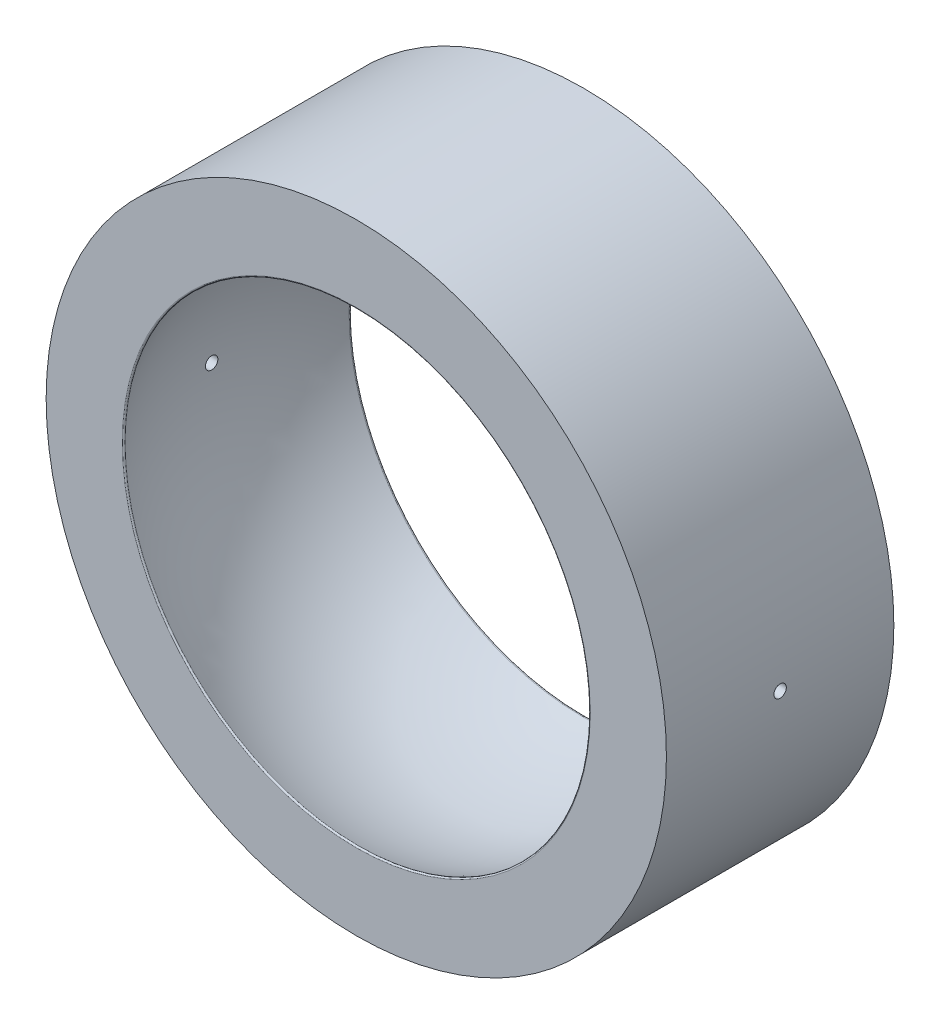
ISO-10303-21;
HEADER;
FILE_DESCRIPTION(('STEP AP214'),'2;1');
FILE_NAME('part.step','',(''),(''),'','','');
FILE_SCHEMA(('AUTOMOTIVE_DESIGN { 1 0 10303 214 1 1 1 1 }'));
ENDSEC;
DATA;
#1=APPLICATION_CONTEXT('core data for automotive mechanical design processes');
#2=APPLICATION_PROTOCOL_DEFINITION('international standard','automotive_design',2000,#1);
#3=PRODUCT_CONTEXT('',#1,'mechanical');
#4=PRODUCT('Part','Part','',(#3));
#5=PRODUCT_RELATED_PRODUCT_CATEGORY('part','',(#4));
#6=PRODUCT_DEFINITION_FORMATION('','',#4);
#7=PRODUCT_DEFINITION_CONTEXT('part definition',#1,'design');
#8=PRODUCT_DEFINITION('design','',#6,#7);
#9=PRODUCT_DEFINITION_SHAPE('','',#8);
#10=(LENGTH_UNIT() NAMED_UNIT(*) SI_UNIT(.MILLI.,.METRE.));
#11=(NAMED_UNIT(*) PLANE_ANGLE_UNIT() SI_UNIT($,.RADIAN.));
#12=(NAMED_UNIT(*) SI_UNIT($,.STERADIAN.) SOLID_ANGLE_UNIT());
#13=UNCERTAINTY_MEASURE_WITH_UNIT(LENGTH_MEASURE(1.E-05),#10,'distance_accuracy_value','');
#14=(GEOMETRIC_REPRESENTATION_CONTEXT(3) GLOBAL_UNCERTAINTY_ASSIGNED_CONTEXT((#13)) GLOBAL_UNIT_ASSIGNED_CONTEXT((#10,
#11,#12)) REPRESENTATION_CONTEXT('',''));
#15=CARTESIAN_POINT('',(0.,0.,0.));
#16=DIRECTION('',(0.,0.,1.));
#17=DIRECTION('',(1.,0.,0.));
#18=AXIS2_PLACEMENT_3D('',#15,#16,#17);
#19=CARTESIAN_POINT('',(68.9999999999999,0.,0.));
#20=DIRECTION('',(0.,0.,0.999999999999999));
#21=DIRECTION('',(-0.999999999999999,0.,0.));
#22=AXIS2_PLACEMENT_3D('',#19,#20,#21);
#23=DEGENERATE_TOROIDAL_SURFACE('',#22,0.0296511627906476,12.4703488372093,.T.);
#24=CARTESIAN_POINT('',(68.9999999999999,0.,-5.41395102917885));
#25=DIRECTION('',(0.,0.,-0.999999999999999));
#26=DIRECTION('',(0.,1.,0.));
#27=AXIS2_PLACEMENT_3D('',#24,#25,#26);
#28=CIRCLE('',#27,11.2634721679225);
#29=CARTESIAN_POINT('',(68.9999999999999,11.2634721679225,-5.41395102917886));
#30=VERTEX_POINT('',#29);
#31=EDGE_CURVE('E57',#30,#30,#28,.T.);
#32=ORIENTED_EDGE('',*,*,#31,.T.);
#33=EDGE_LOOP('',(#32));
#34=FACE_BOUND('',#33,.T.);
#35=CARTESIAN_POINT('',(81.4963909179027,-1.11022302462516E-13,0.300000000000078));
#36=CARTESIAN_POINT('',(81.4963909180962,0.0168414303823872,0.299998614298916));
#37=CARTESIAN_POINT('',(81.4963909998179,0.0336981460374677,0.298576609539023));
#38=CARTESIAN_POINT('',(81.4963913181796,0.0669618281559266,0.292919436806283));
#39=CARTESIAN_POINT('',(81.496391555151,0.0833677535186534,0.288678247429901));
#40=CARTESIAN_POINT('',(81.4963921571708,0.115222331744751,0.277503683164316));
#41=CARTESIAN_POINT('',(81.4963925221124,0.130671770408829,0.270572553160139));
#42=CARTESIAN_POINT('',(81.496393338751,0.160179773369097,0.254218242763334));
#43=CARTESIAN_POINT('',(81.496393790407,0.174238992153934,0.244796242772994));
#44=CARTESIAN_POINT('',(81.4963947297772,0.200579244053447,0.223724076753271));
#45=CARTESIAN_POINT('',(81.4963952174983,0.212859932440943,0.212073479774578));
#46=CARTESIAN_POINT('',(81.4963961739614,0.235292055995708,0.186874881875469));
#47=CARTESIAN_POINT('',(81.4963966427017,0.245443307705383,0.17332671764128));
#48=CARTESIAN_POINT('',(81.4963975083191,0.263326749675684,0.14471892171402));
#49=CARTESIAN_POINT('',(81.4963979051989,0.271059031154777,0.129659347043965));
#50=CARTESIAN_POINT('',(81.4963985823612,0.283885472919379,0.0984559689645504));
#51=CARTESIAN_POINT('',(81.496398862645,0.288979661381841,0.0823121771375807));
#52=CARTESIAN_POINT('',(81.49639927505,0.296385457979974,0.0493984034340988));
#53=CARTESIAN_POINT('',(81.4963994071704,0.298697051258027,0.0326284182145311));
#54=CARTESIAN_POINT('',(81.4963995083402,0.300471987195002,-0.00106161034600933));
#55=CARTESIAN_POINT('',(81.4963994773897,0.299935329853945,-0.0179816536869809));
#56=CARTESIAN_POINT('',(81.4963992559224,0.296029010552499,-0.0514913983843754));
#57=CARTESIAN_POINT('',(81.4963990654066,0.292659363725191,-0.0680811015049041));
#58=CARTESIAN_POINT('',(81.4963985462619,0.2831826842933,-0.100459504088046));
#59=CARTESIAN_POINT('',(81.4963982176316,0.277075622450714,-0.116248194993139));
#60=CARTESIAN_POINT('',(81.4963974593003,0.26229720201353,-0.146576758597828));
#61=CARTESIAN_POINT('',(81.4963970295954,0.253625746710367,-0.161116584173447));
#62=CARTESIAN_POINT('',(81.4963961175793,0.233965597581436,-0.188532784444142));
#63=CARTESIAN_POINT('',(81.4963956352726,0.22297710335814,-0.20140930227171));
#64=CARTESIAN_POINT('',(81.4963946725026,0.198996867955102,-0.225132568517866));
#65=CARTESIAN_POINT('',(81.4963941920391,0.186005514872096,-0.235979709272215));
#66=CARTESIAN_POINT('',(81.4963932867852,0.15837932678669,-0.255344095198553));
#67=CARTESIAN_POINT('',(81.4963928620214,0.143743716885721,-0.26386023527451));
#68=CARTESIAN_POINT('',(81.4963921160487,0.113239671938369,-0.278320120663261));
#69=CARTESIAN_POINT('',(81.4963917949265,0.0973702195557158,-0.284261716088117));
#70=CARTESIAN_POINT('',(81.4963912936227,0.0648851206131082,-0.293382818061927));
#71=CARTESIAN_POINT('',(81.4963911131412,0.0482711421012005,-0.296568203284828));
#72=CARTESIAN_POINT('',(81.4963909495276,0.0210523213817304,-0.299446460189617));
#73=CARTESIAN_POINT('',(81.4963909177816,0.0105291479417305,-0.300000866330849));
#74=CARTESIAN_POINT('',(81.4963909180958,-0.0168414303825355,-0.299998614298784));
#75=CARTESIAN_POINT('',(81.4963909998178,-0.0336981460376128,-0.298576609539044));
#76=CARTESIAN_POINT('',(81.4963913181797,-0.0669618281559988,-0.292919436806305));
#77=CARTESIAN_POINT('',(81.4963915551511,-0.0833677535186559,-0.28867824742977));
#78=CARTESIAN_POINT('',(81.4963921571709,-0.115222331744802,-0.277503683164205));
#79=CARTESIAN_POINT('',(81.4963925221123,-0.130671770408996,-0.270572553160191));
#80=CARTESIAN_POINT('',(81.496393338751,-0.160179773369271,-0.254218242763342));
#81=CARTESIAN_POINT('',(81.4963937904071,-0.174238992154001,-0.244796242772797));
#82=CARTESIAN_POINT('',(81.4963947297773,-0.200579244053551,-0.223724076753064));
#83=CARTESIAN_POINT('',(81.4963952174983,-0.2128599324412,-0.212073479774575));
#84=CARTESIAN_POINT('',(81.4963961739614,-0.23529205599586,-0.186874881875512));
#85=CARTESIAN_POINT('',(81.4963966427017,-0.245443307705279,-0.173326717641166));
#86=CARTESIAN_POINT('',(81.4963975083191,-0.26332674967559,-0.144718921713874));
#87=CARTESIAN_POINT('',(81.4963979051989,-0.271059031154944,-0.129659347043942));
#88=CARTESIAN_POINT('',(81.4963985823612,-0.28388547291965,-0.0984559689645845));
#89=CARTESIAN_POINT('',(81.4963988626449,-0.288979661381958,-0.0823121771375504));
#90=CARTESIAN_POINT('',(81.4963992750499,-0.296385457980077,-0.0493984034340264));
#91=CARTESIAN_POINT('',(81.4963994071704,-0.298697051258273,-0.0326284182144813));
#92=CARTESIAN_POINT('',(81.4963995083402,-0.300471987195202,0.00106161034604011));
#93=CARTESIAN_POINT('',(81.4963994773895,-0.299935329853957,0.0179816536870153));
#94=CARTESIAN_POINT('',(81.4963992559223,-0.296029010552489,0.0514913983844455));
#95=CARTESIAN_POINT('',(81.4963990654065,-0.292659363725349,0.0680811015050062));
#96=CARTESIAN_POINT('',(81.496398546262,-0.283182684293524,0.100459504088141));
#97=CARTESIAN_POINT('',(81.4963982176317,-0.277075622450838,0.116248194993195));
#98=CARTESIAN_POINT('',(81.4963974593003,-0.262297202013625,0.146576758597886));
#99=CARTESIAN_POINT('',(81.4963970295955,-0.253625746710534,0.161116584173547));
#100=CARTESIAN_POINT('',(81.4963961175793,-0.233965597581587,0.188532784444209));
#101=CARTESIAN_POINT('',(81.4963956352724,-0.222977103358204,0.201409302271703));
#102=CARTESIAN_POINT('',(81.4963946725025,-0.198996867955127,0.225132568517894));
#103=CARTESIAN_POINT('',(81.496394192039,-0.186005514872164,0.235979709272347));
#104=CARTESIAN_POINT('',(81.4963932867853,-0.158379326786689,0.255344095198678));
#105=CARTESIAN_POINT('',(81.4963928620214,-0.143743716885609,0.263860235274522));
#106=CARTESIAN_POINT('',(81.4963921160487,-0.113239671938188,0.27832012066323));
#107=CARTESIAN_POINT('',(81.4963917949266,-0.0973702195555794,0.284261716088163));
#108=CARTESIAN_POINT('',(81.4963912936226,-0.0648851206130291,0.29338281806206));
#109=CARTESIAN_POINT('',(81.496391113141,-0.0482711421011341,0.296568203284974));
#110=CARTESIAN_POINT('',(81.4963909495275,-0.021052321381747,0.299446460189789));
#111=CARTESIAN_POINT('',(81.4963909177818,-0.010529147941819,0.300000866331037));
#112=CARTESIAN_POINT('',(81.4963909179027,-1.11022302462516E-13,0.300000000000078));
#113=B_SPLINE_CURVE_WITH_KNOTS('',3,(#35,#36,#37,#38,#39,#40,#41,#42,#43,#44,#45,#46,#47,#48,
#49,#50,#51,#52,#53,#54,#55,#56,#57,#58,#59,#60,#61,#62,#63,#64,#65,#66,#67,#68,#69,#70,#71,#72,
#73,#74,#75,#76,#77,#78,#79,#80,#81,#82,#83,#84,#85,#86,#87,#88,#89,#90,#91,#92,#93,#94,#95,#96,
#97,#98,#99,#100,#101,#102,#103,#104,#105,#106,#107,#108,#109,#110,#111,#112),.UNSPECIFIED.,.T.,
.F.,(4,2,2,2,2,2,2,2,2,2,2,2,2,2,2,2,2,2,2,2,2,2,2,2,2,2,2,2,2,2,2,2,2,2,2,2,2,2,4),(0.,
0.0504912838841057,0.101090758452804,0.151648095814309,0.202181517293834,0.252724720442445,
0.303272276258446,0.353817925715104,0.404363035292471,0.454908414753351,0.505453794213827,
0.555998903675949,0.606544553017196,0.657092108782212,0.707635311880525,0.758168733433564,
0.808726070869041,0.859325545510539,0.909816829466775,0.941383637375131,0.991874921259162,
1.04247439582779,1.09303173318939,1.14356515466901,1.19410835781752,1.24465591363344,
1.29520156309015,1.34574667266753,1.39629205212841,1.44683743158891,1.49738254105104,
1.54792819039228,1.59847574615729,1.64901894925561,1.69955237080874,1.75010970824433,
1.80070918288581,1.851200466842,1.88276727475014),.UNSPECIFIED.);
#114=CARTESIAN_POINT('',(81.4963909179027,-1.11022302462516E-13,0.300000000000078));
#115=VERTEX_POINT('',#114);
#116=EDGE_CURVE('E84',#115,#115,#113,.T.);
#117=ORIENTED_EDGE('',*,*,#116,.F.);
#118=EDGE_LOOP('',(#117));
#119=FACE_BOUND('',#118,.T.);
#120=CARTESIAN_POINT('',(69.0000000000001,0.,5.41395124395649));
#121=DIRECTION('',(0.,0.,0.999999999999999));
#122=DIRECTION('',(0.,-1.,0.));
#123=AXIS2_PLACEMENT_3D('',#120,#121,#122);
#124=CIRCLE('',#123,11.263472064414);
#125=CARTESIAN_POINT('',(69.0000000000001,-11.263472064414,5.4139512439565));
#126=VERTEX_POINT('',#125);
#127=EDGE_CURVE('E107',#126,#126,#124,.T.);
#128=ORIENTED_EDGE('',*,*,#127,.T.);
#129=EDGE_LOOP('',(#128));
#130=FACE_BOUND('',#129,.T.);
#131=CARTESIAN_POINT('',(56.5036090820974,0.,-0.299999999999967));
#132=CARTESIAN_POINT('',(56.503609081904,0.0168414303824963,-0.299998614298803));
#133=CARTESIAN_POINT('',(56.5036090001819,0.0336981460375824,-0.298576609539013));
#134=CARTESIAN_POINT('',(56.5036086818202,0.066961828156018,-0.292919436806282));
#135=CARTESIAN_POINT('',(56.503608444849,0.083367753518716,-0.288678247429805));
#136=CARTESIAN_POINT('',(56.5036078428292,0.11522233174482,-0.277503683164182));
#137=CARTESIAN_POINT('',(56.5036074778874,0.130671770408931,-0.27057255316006));
#138=CARTESIAN_POINT('',(56.5036066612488,0.160179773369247,-0.254218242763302));
#139=CARTESIAN_POINT('',(56.503606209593,0.174238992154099,-0.244796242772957));
#140=CARTESIAN_POINT('',(56.5036052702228,0.200579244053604,-0.223724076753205));
#141=CARTESIAN_POINT('',(56.5036047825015,0.212859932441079,-0.212073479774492));
#142=CARTESIAN_POINT('',(56.5036038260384,0.235292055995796,-0.186874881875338));
#143=CARTESIAN_POINT('',(56.5036033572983,0.245443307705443,-0.173326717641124));
#144=CARTESIAN_POINT('',(56.5036024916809,0.263326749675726,-0.144718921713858));
#145=CARTESIAN_POINT('',(56.5036020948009,0.27105903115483,-0.129659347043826));
#146=CARTESIAN_POINT('',(56.5036014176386,0.283885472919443,-0.0984559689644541));
#147=CARTESIAN_POINT('',(56.5036011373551,0.288979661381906,-0.0823121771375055));
#148=CARTESIAN_POINT('',(56.5036007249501,0.296385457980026,-0.049398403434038));
#149=CARTESIAN_POINT('',(56.5036005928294,0.298697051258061,-0.0326284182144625));
#150=CARTESIAN_POINT('',(56.5036004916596,0.300471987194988,0.00106161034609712));
#151=CARTESIAN_POINT('',(56.5036005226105,0.299935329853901,0.0179816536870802));
#152=CARTESIAN_POINT('',(56.5036007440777,0.296029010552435,0.0514913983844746));
#153=CARTESIAN_POINT('',(56.5036009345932,0.292659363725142,0.0680811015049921));
#154=CARTESIAN_POINT('',(56.5036014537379,0.283182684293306,0.100459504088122));
#155=CARTESIAN_POINT('',(56.5036017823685,0.277075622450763,0.116248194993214));
#156=CARTESIAN_POINT('',(56.5036025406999,0.262297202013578,0.146576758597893));
#157=CARTESIAN_POINT('',(56.5036029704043,0.253625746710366,0.161116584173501));
#158=CARTESIAN_POINT('',(56.5036038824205,0.233965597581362,0.188532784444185));
#159=CARTESIAN_POINT('',(56.5036043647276,0.222977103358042,0.201409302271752));
#160=CARTESIAN_POINT('',(56.5036053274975,0.198996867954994,0.225132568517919));
#161=CARTESIAN_POINT('',(56.5036058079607,0.186005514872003,0.235979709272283));
#162=CARTESIAN_POINT('',(56.5036067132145,0.158379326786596,0.255344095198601));
#163=CARTESIAN_POINT('',(56.5036071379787,0.143743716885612,0.263860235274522));
#164=CARTESIAN_POINT('',(56.5036078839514,0.113239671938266,0.278320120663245));
#165=CARTESIAN_POINT('',(56.5036082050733,0.0973702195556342,0.284261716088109));
#166=CARTESIAN_POINT('',(56.5036087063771,0.0648851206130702,0.293382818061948));
#167=CARTESIAN_POINT('',(56.5036088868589,0.0482711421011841,0.29656820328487));
#168=CARTESIAN_POINT('',(56.5036090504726,0.0210523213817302,0.299446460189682));
#169=CARTESIAN_POINT('',(56.5036090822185,0.0105291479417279,0.30000086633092));
#170=CARTESIAN_POINT('',(56.5036090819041,-0.016841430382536,0.299998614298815));
#171=CARTESIAN_POINT('',(56.5036090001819,-0.0336981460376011,0.298576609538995));
#172=CARTESIAN_POINT('',(56.5036086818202,-0.0669618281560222,0.292919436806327));
#173=CARTESIAN_POINT('',(56.503608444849,-0.0833677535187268,0.288678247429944));
#174=CARTESIAN_POINT('',(56.5036078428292,-0.115222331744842,0.277503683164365));
#175=CARTESIAN_POINT('',(56.5036074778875,-0.130671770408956,0.270572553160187));
#176=CARTESIAN_POINT('',(56.5036066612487,-0.160179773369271,0.254218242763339));
#177=CARTESIAN_POINT('',(56.5036062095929,-0.17423899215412,0.244796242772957));
#178=CARTESIAN_POINT('',(56.5036052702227,-0.200579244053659,0.223724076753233));
#179=CARTESIAN_POINT('',(56.5036047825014,-0.212859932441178,0.212073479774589));
#180=CARTESIAN_POINT('',(56.5036038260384,-0.23529205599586,0.186874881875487));
#181=CARTESIAN_POINT('',(56.5036033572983,-0.24544330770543,0.173326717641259));
#182=CARTESIAN_POINT('',(56.5036024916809,-0.263326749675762,0.14471892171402));
#183=CARTESIAN_POINT('',(56.5036020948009,-0.271059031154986,0.129659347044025));
#184=CARTESIAN_POINT('',(56.5036014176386,-0.283885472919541,0.0984559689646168));
#185=CARTESIAN_POINT('',(56.5036011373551,-0.288979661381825,0.082312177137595));
#186=CARTESIAN_POINT('',(56.5036007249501,-0.296385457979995,0.0493984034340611));
#187=CARTESIAN_POINT('',(56.5036005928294,-0.298697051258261,0.0326284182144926));
#188=CARTESIAN_POINT('',(56.5036004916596,-0.300471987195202,-0.00106161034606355));
#189=CARTESIAN_POINT('',(56.5036005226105,-0.299935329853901,-0.01798165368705));
#190=CARTESIAN_POINT('',(56.5036007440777,-0.296029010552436,-0.0514913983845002));
#191=CARTESIAN_POINT('',(56.5036009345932,-0.292659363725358,-0.0680811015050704));
#192=CARTESIAN_POINT('',(56.5036014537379,-0.283182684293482,-0.100459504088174));
#193=CARTESIAN_POINT('',(56.5036017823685,-0.277075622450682,-0.116248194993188));
#194=CARTESIAN_POINT('',(56.5036025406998,-0.262297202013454,-0.146576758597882));
#195=CARTESIAN_POINT('',(56.5036029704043,-0.253625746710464,-0.161116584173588));
#196=CARTESIAN_POINT('',(56.5036038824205,-0.233965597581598,-0.188532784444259));
#197=CARTESIAN_POINT('',(56.5036043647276,-0.222977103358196,-0.201409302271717));
#198=CARTESIAN_POINT('',(56.5036053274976,-0.198996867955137,-0.225132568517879));
#199=CARTESIAN_POINT('',(56.5036058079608,-0.18600551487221,-0.23597970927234));
#200=CARTESIAN_POINT('',(56.5036067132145,-0.158379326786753,-0.255344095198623));
#201=CARTESIAN_POINT('',(56.5036071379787,-0.143743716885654,-0.263860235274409));
#202=CARTESIAN_POINT('',(56.5036078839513,-0.113239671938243,-0.278320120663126));
#203=CARTESIAN_POINT('',(56.5036082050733,-0.0973702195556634,-0.284261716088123));
#204=CARTESIAN_POINT('',(56.5036087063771,-0.0648851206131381,-0.293382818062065));
#205=CARTESIAN_POINT('',(56.5036088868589,-0.04827114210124,-0.296568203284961));
#206=CARTESIAN_POINT('',(56.5036090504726,-0.0210523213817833,-0.299446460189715));
#207=CARTESIAN_POINT('',(56.5036090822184,-0.0105291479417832,-0.300000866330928));
#208=CARTESIAN_POINT('',(56.5036090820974,0.,-0.299999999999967));
#209=B_SPLINE_CURVE_WITH_KNOTS('',3,(#131,#132,#133,#134,#135,#136,#137,#138,#139,#140,#141,
#142,#143,#144,#145,#146,#147,#148,#149,#150,#151,#152,#153,#154,#155,#156,#157,#158,#159,#160,
#161,#162,#163,#164,#165,#166,#167,#168,#169,#170,#171,#172,#173,#174,#175,#176,#177,#178,#179,
#180,#181,#182,#183,#184,#185,#186,#187,#188,#189,#190,#191,#192,#193,#194,#195,#196,#197,#198,
#199,#200,#201,#202,#203,#204,#205,#206,#207,#208),.UNSPECIFIED.,.T.,.F.,(4,2,2,2,2,2,2,2,2,2,2,
2,2,2,2,2,2,2,2,2,2,2,2,2,2,2,2,2,2,2,2,2,2,2,2,2,2,2,4),(0.,0.0504912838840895,
0.101090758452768,0.151648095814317,0.202181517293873,0.252724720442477,0.303272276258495,
0.353817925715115,0.404363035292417,0.454908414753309,0.505453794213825,0.555998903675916,
0.606544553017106,0.657092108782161,0.70763531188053,0.758168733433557,0.808726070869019,
0.859325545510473,0.909816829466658,0.941383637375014,0.99187492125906,1.04247439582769,
1.09303173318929,1.14356515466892,1.19410835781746,1.24465591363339,1.29520156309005,
1.34574667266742,1.39629205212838,1.44683743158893,1.49738254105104,1.54792819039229,
1.59847574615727,1.64901894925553,1.6995523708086,1.75010970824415,1.80070918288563,
1.8512004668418,1.88276727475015),.UNSPECIFIED.);
#210=CARTESIAN_POINT('',(56.5036090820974,0.,-0.299999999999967));
#211=VERTEX_POINT('',#210);
#212=EDGE_CURVE('E40',#211,#211,#209,.T.);
#213=ORIENTED_EDGE('',*,*,#212,.F.);
#214=EDGE_LOOP('',(#213));
#215=FACE_BOUND('',#214,.T.);
#216=ADVANCED_FACE('F36',(#34,#119,#130,#215),#23,.F.);
#217=CARTESIAN_POINT('',(68.9999999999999,0.,-5.43999999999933));
#218=DIRECTION('',(0.,0.,0.999999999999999));
#219=DIRECTION('',(-0.999999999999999,0.,0.));
#220=AXIS2_PLACEMENT_3D('',#217,#218,#219);
#221=TOROIDAL_SURFACE('',#220,11.3175226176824,0.06000000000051);
#222=CARTESIAN_POINT('',(69.0000000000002,0.,-5.49999999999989));
#223=DIRECTION('',(0.,0.,-0.999999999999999));
#224=DIRECTION('',(-0.999999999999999,0.,0.));
#225=AXIS2_PLACEMENT_3D('',#222,#223,#224);
#226=CIRCLE('',#225,11.3175226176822);
#227=CARTESIAN_POINT('',(57.682477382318,0.,-5.4999999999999));
#228=VERTEX_POINT('',#227);
#229=EDGE_CURVE('E90',#228,#228,#226,.T.);
#230=ORIENTED_EDGE('',*,*,#229,.T.);
#231=EDGE_LOOP('',(#230));
#232=FACE_BOUND('',#231,.T.);
#233=ORIENTED_EDGE('',*,*,#31,.F.);
#234=EDGE_LOOP('',(#233));
#235=FACE_BOUND('',#234,.T.);
#236=ADVANCED_FACE('F93',(#232,#235),#221,.T.);
#237=CARTESIAN_POINT('',(69.0000000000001,0.,5.44));
#238=DIRECTION('',(0.,0.,0.999999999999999));
#239=DIRECTION('',(0.,1.,0.));
#240=AXIS2_PLACEMENT_3D('',#237,#238,#239);
#241=TOROIDAL_SURFACE('',#240,11.3175226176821,0.0599999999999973);
#242=CARTESIAN_POINT('',(69.,-1.11022302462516E-13,5.50000000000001));
#243=DIRECTION('',(0.,0.,-0.999999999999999));
#244=DIRECTION('',(0.,1.,0.));
#245=AXIS2_PLACEMENT_3D('',#242,#243,#244);
#246=CIRCLE('',#245,11.3175226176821);
#247=CARTESIAN_POINT('',(69.,11.317522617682,5.5));
#248=VERTEX_POINT('',#247);
#249=EDGE_CURVE('E111',#248,#248,#246,.F.);
#250=ORIENTED_EDGE('',*,*,#249,.T.);
#251=EDGE_LOOP('',(#250));
#252=FACE_BOUND('',#251,.T.);
#253=ORIENTED_EDGE('',*,*,#127,.F.);
#254=EDGE_LOOP('',(#253));
#255=FACE_BOUND('',#254,.T.);
#256=ADVANCED_FACE('F38',(#252,#255),#241,.T.);
#257=CARTESIAN_POINT('',(85.,-1.11022302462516E-13,0.));
#258=DIRECTION('',(-0.999999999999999,0.,0.));
#259=DIRECTION('',(0.,0.,-0.999999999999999));
#260=AXIS2_PLACEMENT_3D('',#257,#258,#259);
#261=CYLINDRICAL_SURFACE('',#260,0.3);
#262=CARTESIAN_POINT('',(54.0000000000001,0.,-0.299999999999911));
#263=CARTESIAN_POINT('',(54.0000000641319,-0.0168396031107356,-0.299998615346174));
#264=CARTESIAN_POINT('',(54.0000286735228,-0.0336944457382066,-0.298576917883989));
#265=CARTESIAN_POINT('',(54.0001401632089,-0.0669543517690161,-0.292921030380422));
#266=CARTESIAN_POINT('',(54.0002231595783,-0.0833583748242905,-0.288680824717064));
#267=CARTESIAN_POINT('',(54.000433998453,-0.115209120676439,-0.277509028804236));
#268=CARTESIAN_POINT('',(54.0005618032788,-0.130656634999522,-0.270579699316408));
#269=CARTESIAN_POINT('',(54.0008478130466,-0.160161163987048,-0.25422979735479));
#270=CARTESIAN_POINT('',(54.0010060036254,-0.174218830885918,-0.244810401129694));
#271=CARTESIAN_POINT('',(54.0013350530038,-0.200558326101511,-0.223742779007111));
#272=CARTESIAN_POINT('',(54.0015059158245,-0.21283958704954,-0.212093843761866));
#273=CARTESIAN_POINT('',(54.0018410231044,-0.235273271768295,-0.186898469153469));
#274=CARTESIAN_POINT('',(54.0020052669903,-0.245425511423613,-0.173351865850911));
#275=CARTESIAN_POINT('',(54.002308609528,-0.263312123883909,-0.144745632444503));
#276=CARTESIAN_POINT('',(54.0024477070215,-0.271046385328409,-0.129685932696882));
#277=CARTESIAN_POINT('',(54.0026850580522,-0.283876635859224,-0.0984816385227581));
#278=CARTESIAN_POINT('',(54.0027833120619,-0.28897265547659,-0.0823370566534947));
#279=CARTESIAN_POINT('',(54.0029278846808,-0.29638124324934,-0.0494233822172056));
#280=CARTESIAN_POINT('',(54.0029742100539,-0.298694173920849,-0.0326543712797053));
#281=CARTESIAN_POINT('',(54.0030097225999,-0.300472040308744,0.00103400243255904));
#282=CARTESIAN_POINT('',(54.0029989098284,-0.299936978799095,0.0179533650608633));
#283=CARTESIAN_POINT('',(54.0029213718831,-0.296034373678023,0.0514595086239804));
#284=CARTESIAN_POINT('',(54.0028546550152,-0.29266725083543,0.0680463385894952));
#285=CARTESIAN_POINT('',(54.0026728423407,-0.283196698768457,0.100419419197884));
#286=CARTESIAN_POINT('',(54.0025577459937,-0.277093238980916,0.1162056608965));
#287=CARTESIAN_POINT('',(54.0022921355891,-0.26232253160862,0.146531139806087));
#288=CARTESIAN_POINT('',(54.0021416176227,-0.253655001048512,0.161070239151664));
#289=CARTESIAN_POINT('',(54.0018221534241,-0.234003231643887,0.188485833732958));
#290=CARTESIAN_POINT('',(54.0016532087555,-0.223019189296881,0.201362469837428));
#291=CARTESIAN_POINT('',(54.0013159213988,-0.199045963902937,0.225089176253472));
#292=CARTESIAN_POINT('',(54.0011475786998,-0.186056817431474,0.235939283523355));
#293=CARTESIAN_POINT('',(54.0008303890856,-0.158434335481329,0.255309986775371));
#294=CARTESIAN_POINT('',(54.0006815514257,-0.143800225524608,0.263829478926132));
#295=CARTESIAN_POINT('',(54.0004201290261,-0.113298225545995,0.278296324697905));
#296=CARTESIAN_POINT('',(54.0003075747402,-0.0974293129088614,0.284241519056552));
#297=CARTESIAN_POINT('',(54.0001318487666,-0.0649444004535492,0.29336975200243));
#298=CARTESIAN_POINT('',(54.0000685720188,-0.0483300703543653,0.296558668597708));
#299=CARTESIAN_POINT('',(54.000011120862,-0.0210913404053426,0.299444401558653));
#300=CARTESIAN_POINT('',(53.9999999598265,-0.0105486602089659,0.300000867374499));
#301=CARTESIAN_POINT('',(54.0000000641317,0.0168396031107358,0.29999861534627));
#302=CARTESIAN_POINT('',(54.0000286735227,0.0336944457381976,0.298576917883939));
#303=CARTESIAN_POINT('',(54.0001401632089,0.066954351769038,0.292921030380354));
#304=CARTESIAN_POINT('',(54.0002231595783,0.0833583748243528,0.288680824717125));
#305=CARTESIAN_POINT('',(54.000433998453,0.115209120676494,0.277509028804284));
#306=CARTESIAN_POINT('',(54.0005618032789,0.130656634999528,0.270579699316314));
#307=CARTESIAN_POINT('',(54.0008478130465,0.16016116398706,0.2542297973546));
#308=CARTESIAN_POINT('',(54.0010060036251,0.174218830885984,0.244810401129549));
#309=CARTESIAN_POINT('',(54.0013350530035,0.20055832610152,0.223742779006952));
#310=CARTESIAN_POINT('',(54.0015059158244,0.212839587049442,0.21209384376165));
#311=CARTESIAN_POINT('',(54.0018410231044,0.23527327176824,0.186898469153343));
#312=CARTESIAN_POINT('',(54.0020052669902,0.245425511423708,0.173351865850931));
#313=CARTESIAN_POINT('',(54.0023086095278,0.263312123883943,0.144745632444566));
#314=CARTESIAN_POINT('',(54.0024477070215,0.271046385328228,0.12968593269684));
#315=CARTESIAN_POINT('',(54.0026850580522,0.283876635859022,0.0984816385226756));
#316=CARTESIAN_POINT('',(54.0027833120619,0.288972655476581,0.0823370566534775));
#317=CARTESIAN_POINT('',(54.0029278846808,0.296381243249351,0.0494233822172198));
#318=CARTESIAN_POINT('',(54.0029742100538,0.298694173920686,0.0326543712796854));
#319=CARTESIAN_POINT('',(54.0030097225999,0.300472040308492,-0.00103400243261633));
#320=CARTESIAN_POINT('',(54.0029989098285,0.299936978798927,-0.0179533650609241));
#321=CARTESIAN_POINT('',(54.0029213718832,0.29603437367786,-0.0514595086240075));
#322=CARTESIAN_POINT('',(54.0028546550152,0.292667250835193,-0.0680463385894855));
#323=CARTESIAN_POINT('',(54.0026728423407,0.283196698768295,-0.100419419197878));
#324=CARTESIAN_POINT('',(54.0025577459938,0.277093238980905,-0.116205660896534));
#325=CARTESIAN_POINT('',(54.0022921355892,0.262322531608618,-0.14653113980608));
#326=CARTESIAN_POINT('',(54.0021416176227,0.253655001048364,-0.161070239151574));
#327=CARTESIAN_POINT('',(54.0018221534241,0.234003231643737,-0.188485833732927));
#328=CARTESIAN_POINT('',(54.0016532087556,0.223019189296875,-0.201362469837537));
#329=CARTESIAN_POINT('',(54.0013159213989,0.199045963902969,-0.22508917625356));
#330=CARTESIAN_POINT('',(54.0011475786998,0.186056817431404,-0.235939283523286));
#331=CARTESIAN_POINT('',(54.0008303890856,0.158434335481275,-0.255309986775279));
#332=CARTESIAN_POINT('',(54.0006815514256,0.143800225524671,-0.263829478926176));
#333=CARTESIAN_POINT('',(54.0004201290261,0.113298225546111,-0.278296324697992));
#334=CARTESIAN_POINT('',(54.0003075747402,0.0974293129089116,-0.284241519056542));
#335=CARTESIAN_POINT('',(54.0001318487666,0.0649444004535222,-0.293369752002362));
#336=CARTESIAN_POINT('',(54.0000685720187,0.0483300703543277,-0.29655866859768));
#337=CARTESIAN_POINT('',(54.0000111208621,0.0210913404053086,-0.299444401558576));
#338=CARTESIAN_POINT('',(53.9999999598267,0.0105486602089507,-0.300000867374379));
#339=CARTESIAN_POINT('',(54.0000000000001,0.,-0.299999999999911));
#340=B_SPLINE_CURVE_WITH_KNOTS('',3,(#262,#263,#264,#265,#266,#267,#268,#269,#270,#271,#272,
#273,#274,#275,#276,#277,#278,#279,#280,#281,#282,#283,#284,#285,#286,#287,#288,#289,#290,#291,
#292,#293,#294,#295,#296,#297,#298,#299,#300,#301,#302,#303,#304,#305,#306,#307,#308,#309,#310,
#311,#312,#313,#314,#315,#316,#317,#318,#319,#320,#321,#322,#323,#324,#325,#326,#327,#328,#329,
#330,#331,#332,#333,#334,#335,#336,#337,#338,#339),.UNSPECIFIED.,.T.,.F.,(4,2,2,2,2,2,2,2,2,2,2,
2,2,2,2,2,2,2,2,2,2,2,2,2,2,2,2,2,2,2,2,2,2,2,2,2,2,2,4),(0.,0.0504857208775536,
0.101079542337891,0.151630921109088,0.202158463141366,0.252702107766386,0.303250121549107,
0.353800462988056,0.404350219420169,0.454893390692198,0.505436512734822,0.555972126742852,
0.606508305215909,0.65705006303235,0.707587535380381,0.758124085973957,0.808684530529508,
0.859287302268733,0.909781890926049,0.941407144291,0.991892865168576,1.04248668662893,
1.09303806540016,1.14356560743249,1.19410925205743,1.24465726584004,1.29520760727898,
1.3457573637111,1.39630053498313,1.44684365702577,1.49737927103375,1.54791544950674,
1.5984572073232,1.64899467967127,1.69953123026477,1.75009167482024,1.80069444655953,
1.85118903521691,1.8828142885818),.UNSPECIFIED.);
#341=CARTESIAN_POINT('',(54.0000000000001,0.,-0.299999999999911));
#342=VERTEX_POINT('',#341);
#343=EDGE_CURVE('E67',#342,#342,#340,.T.);
#344=ORIENTED_EDGE('',*,*,#343,.T.);
#345=EDGE_LOOP('',(#344));
#346=FACE_BOUND('',#345,.T.);
#347=ORIENTED_EDGE('',*,*,#212,.T.);
#348=EDGE_LOOP('',(#347));
#349=FACE_BOUND('',#348,.T.);
#350=ADVANCED_FACE('F80',(#346,#349),#261,.F.);
#351=CARTESIAN_POINT('',(85.,-1.11022302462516E-13,0.));
#352=DIRECTION('',(-0.999999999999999,0.,0.));
#353=DIRECTION('',(0.,0.,-0.999999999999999));
#354=AXIS2_PLACEMENT_3D('',#351,#352,#353);
#355=CYLINDRICAL_SURFACE('',#354,0.3);
#356=ORIENTED_EDGE('',*,*,#116,.T.);
#357=EDGE_LOOP('',(#356));
#358=FACE_BOUND('',#357,.T.);
#359=CARTESIAN_POINT('',(84.,-2.22044604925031E-13,0.299999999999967));
#360=CARTESIAN_POINT('',(83.9999999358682,-0.016839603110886,0.299998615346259));
#361=CARTESIAN_POINT('',(83.999971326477,-0.0336944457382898,0.298576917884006));
#362=CARTESIAN_POINT('',(83.9998598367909,-0.0669543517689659,0.292921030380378));
#363=CARTESIAN_POINT('',(83.9997768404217,-0.0833583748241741,0.288680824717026));
#364=CARTESIAN_POINT('',(83.999566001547,-0.115209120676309,0.277509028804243));
#365=CARTESIAN_POINT('',(83.999438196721,-0.130656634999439,0.270579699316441));
#366=CARTESIAN_POINT('',(83.9991521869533,-0.160161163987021,0.254229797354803));
#367=CARTESIAN_POINT('',(83.9989939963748,-0.174218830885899,0.244810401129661));
#368=CARTESIAN_POINT('',(83.9986649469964,-0.200558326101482,0.223742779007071));
#369=CARTESIAN_POINT('',(83.9984940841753,-0.212839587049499,0.212093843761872));
#370=CARTESIAN_POINT('',(83.9981589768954,-0.235273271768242,0.18689846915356));
#371=CARTESIAN_POINT('',(83.99799473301,-0.245425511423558,0.173351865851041));
#372=CARTESIAN_POINT('',(83.9976913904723,-0.263312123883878,0.144745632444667));
#373=CARTESIAN_POINT('',(83.9975522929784,-0.271046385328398,0.129685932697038));
#374=CARTESIAN_POINT('',(83.9973149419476,-0.283876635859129,0.0984816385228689));
#375=CARTESIAN_POINT('',(83.9972166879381,-0.288972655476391,0.0823370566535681));
#376=CARTESIAN_POINT('',(83.9970721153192,-0.296381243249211,0.0494233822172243));
#377=CARTESIAN_POINT('',(83.9970257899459,-0.29869417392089,0.0326543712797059));
#378=CARTESIAN_POINT('',(83.9969902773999,-0.300472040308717,-0.00103400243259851));
#379=CARTESIAN_POINT('',(83.9970010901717,-0.299936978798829,-0.0179533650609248));
#380=CARTESIAN_POINT('',(83.997078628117,-0.296034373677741,-0.0514595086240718));
#381=CARTESIAN_POINT('',(83.9971453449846,-0.292667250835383,-0.0680463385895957));
#382=CARTESIAN_POINT('',(83.997327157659,-0.283196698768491,-0.100419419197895));
#383=CARTESIAN_POINT('',(83.9974422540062,-0.277093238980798,-0.116205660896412));
#384=CARTESIAN_POINT('',(83.9977078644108,-0.262322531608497,-0.14653113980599));
#385=CARTESIAN_POINT('',(83.9978583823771,-0.253655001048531,-0.161070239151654));
#386=CARTESIAN_POINT('',(83.9981778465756,-0.23400323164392,-0.188485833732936));
#387=CARTESIAN_POINT('',(83.9983467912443,-0.223019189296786,-0.201362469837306));
#388=CARTESIAN_POINT('',(83.998684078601,-0.199045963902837,-0.225089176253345));
#389=CARTESIAN_POINT('',(83.9988524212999,-0.1860568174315,-0.235939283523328));
#390=CARTESIAN_POINT('',(83.9991696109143,-0.15843433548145,-0.255309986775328));
#391=CARTESIAN_POINT('',(83.9993184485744,-0.143800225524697,-0.263829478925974));
#392=CARTESIAN_POINT('',(83.999579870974,-0.113298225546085,-0.27829632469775));
#393=CARTESIAN_POINT('',(83.9996924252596,-0.0974293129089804,-0.284241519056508));
#394=CARTESIAN_POINT('',(83.9998681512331,-0.0649444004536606,-0.293369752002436));
#395=CARTESIAN_POINT('',(83.9999314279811,-0.0483300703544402,-0.296558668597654));
#396=CARTESIAN_POINT('',(83.999988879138,-0.0210913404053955,-0.299444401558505));
#397=CARTESIAN_POINT('',(84.0000000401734,-0.0105486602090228,-0.300000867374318));
#398=CARTESIAN_POINT('',(83.9999999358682,0.0168396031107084,-0.299998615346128));
#399=CARTESIAN_POINT('',(83.999971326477,0.0336944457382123,-0.298576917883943));
#400=CARTESIAN_POINT('',(83.9998598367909,0.0669543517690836,-0.29292103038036));
#401=CARTESIAN_POINT('',(83.9997768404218,0.0833583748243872,-0.288680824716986));
#402=CARTESIAN_POINT('',(83.9995660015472,0.115209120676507,-0.277509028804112));
#403=CARTESIAN_POINT('',(83.999438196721,0.130656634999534,-0.270579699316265));
#404=CARTESIAN_POINT('',(83.9991521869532,0.160161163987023,-0.254229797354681));
#405=CARTESIAN_POINT('',(83.9989939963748,0.174218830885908,-0.244810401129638));
#406=CARTESIAN_POINT('',(83.9986649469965,0.200558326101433,-0.223742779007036));
#407=CARTESIAN_POINT('',(83.9984940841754,0.212839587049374,-0.212093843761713));
#408=CARTESIAN_POINT('',(83.9981589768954,0.235273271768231,-0.186898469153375));
#409=CARTESIAN_POINT('',(83.9979947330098,0.245425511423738,-0.173351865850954));
#410=CARTESIAN_POINT('',(83.9976913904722,0.263312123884,-0.144745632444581));
#411=CARTESIAN_POINT('',(83.9975522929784,0.271046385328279,-0.129685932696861));
#412=CARTESIAN_POINT('',(83.9973149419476,0.283876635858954,-0.0984816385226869));
#413=CARTESIAN_POINT('',(83.997216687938,0.288972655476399,-0.0823370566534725));
#414=CARTESIAN_POINT('',(83.9970721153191,0.296381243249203,-0.0494233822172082));
#415=CARTESIAN_POINT('',(83.9970257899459,0.298694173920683,-0.032654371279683));
#416=CARTESIAN_POINT('',(83.9969902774,0.300472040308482,0.00103400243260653));
#417=CARTESIAN_POINT('',(83.9970010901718,0.299936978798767,0.0179533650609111));
#418=CARTESIAN_POINT('',(83.997078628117,0.296034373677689,0.0514595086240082));
#419=CARTESIAN_POINT('',(83.9971453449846,0.292667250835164,0.0680463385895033));
#420=CARTESIAN_POINT('',(83.997327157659,0.283196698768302,0.100419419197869));
#421=CARTESIAN_POINT('',(83.9974422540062,0.277093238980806,0.116205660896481));
#422=CARTESIAN_POINT('',(83.9977078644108,0.262322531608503,0.146531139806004));
#423=CARTESIAN_POINT('',(83.997858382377,0.253655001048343,0.161070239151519));
#424=CARTESIAN_POINT('',(83.9981778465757,0.234003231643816,0.188485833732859));
#425=CARTESIAN_POINT('',(83.9983467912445,0.223019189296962,0.201362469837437));
#426=CARTESIAN_POINT('',(83.9986840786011,0.199045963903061,0.225089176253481));
#427=CARTESIAN_POINT('',(83.9988524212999,0.186056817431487,0.235939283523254));
#428=CARTESIAN_POINT('',(83.9991696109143,0.158434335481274,0.255309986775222));
#429=CARTESIAN_POINT('',(83.9993184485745,0.143800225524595,0.263829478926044));
#430=CARTESIAN_POINT('',(83.999579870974,0.113298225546,0.278296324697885));
#431=CARTESIAN_POINT('',(83.9996924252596,0.097429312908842,0.284241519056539));
#432=CARTESIAN_POINT('',(83.9998681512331,0.06494440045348,0.29336975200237));
#433=CARTESIAN_POINT('',(83.9999314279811,0.0483300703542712,0.296558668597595));
#434=CARTESIAN_POINT('',(83.999988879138,0.0210913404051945,0.299444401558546));
#435=CARTESIAN_POINT('',(84.0000000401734,0.0105486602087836,0.300000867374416));
#436=CARTESIAN_POINT('',(84.,-2.22044604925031E-13,0.299999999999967));
#437=B_SPLINE_CURVE_WITH_KNOTS('',3,(#359,#360,#361,#362,#363,#364,#365,#366,#367,#368,#369,
#370,#371,#372,#373,#374,#375,#376,#377,#378,#379,#380,#381,#382,#383,#384,#385,#386,#387,#388,
#389,#390,#391,#392,#393,#394,#395,#396,#397,#398,#399,#400,#401,#402,#403,#404,#405,#406,#407,
#408,#409,#410,#411,#412,#413,#414,#415,#416,#417,#418,#419,#420,#421,#422,#423,#424,#425,#426,
#427,#428,#429,#430,#431,#432,#433,#434,#435,#436),.UNSPECIFIED.,.T.,.F.,(4,2,2,2,2,2,2,2,2,2,2,
2,2,2,2,2,2,2,2,2,2,2,2,2,2,2,2,2,2,2,2,2,2,2,2,2,2,2,4),(0.,0.0504857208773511,
0.101079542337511,0.151630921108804,0.202158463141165,0.252702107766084,0.303250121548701,
0.353800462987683,0.404350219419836,0.454893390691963,0.505436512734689,0.555972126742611,
0.60650830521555,0.657050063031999,0.707587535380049,0.758124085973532,0.808684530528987,
0.859287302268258,0.909781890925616,0.941407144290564,0.991892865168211,1.04248668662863,
1.09303806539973,1.14356560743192,1.19410925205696,1.24465726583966,1.29520760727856,
1.34575736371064,1.3963005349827,1.44684365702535,1.49737927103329,1.54791544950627,
1.59845720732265,1.64899467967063,1.69953123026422,1.7500916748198,1.80069444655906,
1.85118903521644,1.8828142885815),.UNSPECIFIED.);
#438=CARTESIAN_POINT('',(84.,-2.22044604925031E-13,0.299999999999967));
#439=VERTEX_POINT('',#438);
#440=EDGE_CURVE('E54',#439,#439,#437,.T.);
#441=ORIENTED_EDGE('',*,*,#440,.T.);
#442=EDGE_LOOP('',(#441));
#443=FACE_BOUND('',#442,.T.);
#444=ADVANCED_FACE('F75',(#358,#443),#355,.F.);
#445=CARTESIAN_POINT('',(69.0000000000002,-13.158761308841,-5.50000000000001));
#446=DIRECTION('',(0.,0.,-0.999999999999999));
#447=DIRECTION('',(0.999999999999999,0.,0.));
#448=AXIS2_PLACEMENT_3D('',#445,#446,#447);
#449=PLANE('',#448);
#450=CARTESIAN_POINT('',(69.0000000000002,0.,-5.49999999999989));
#451=DIRECTION('',(0.,0.,-0.999999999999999));
#452=DIRECTION('',(-0.999999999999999,0.,0.));
#453=AXIS2_PLACEMENT_3D('',#450,#451,#452);
#454=CIRCLE('',#453,15.);
#455=CARTESIAN_POINT('',(54.0000000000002,0.,-5.4999999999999));
#456=VERTEX_POINT('',#455);
#457=EDGE_CURVE('E49',#456,#456,#454,.T.);
#458=ORIENTED_EDGE('',*,*,#457,.T.);
#459=EDGE_LOOP('',(#458));
#460=FACE_BOUND('',#459,.T.);
#461=ORIENTED_EDGE('',*,*,#229,.F.);
#462=EDGE_LOOP('',(#461));
#463=FACE_BOUND('',#462,.T.);
#464=ADVANCED_FACE('F79',(#460,#463),#449,.T.);
#465=CARTESIAN_POINT('',(69.0000000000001,-13.1587613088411,5.50000000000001));
#466=DIRECTION('',(0.,0.,0.999999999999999));
#467=DIRECTION('',(-0.999999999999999,0.,0.));
#468=AXIS2_PLACEMENT_3D('',#465,#466,#467);
#469=PLANE('',#468);
#470=CARTESIAN_POINT('',(69.,-1.11022302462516E-13,5.50000000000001));
#471=DIRECTION('',(0.,0.,-0.999999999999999));
#472=DIRECTION('',(-0.999999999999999,0.,0.));
#473=AXIS2_PLACEMENT_3D('',#470,#471,#472);
#474=CIRCLE('',#473,15.);
#475=CARTESIAN_POINT('',(54.,-1.0769163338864E-13,5.5));
#476=VERTEX_POINT('',#475);
#477=EDGE_CURVE('E10',#476,#476,#474,.F.);
#478=ORIENTED_EDGE('',*,*,#477,.T.);
#479=EDGE_LOOP('',(#478));
#480=FACE_BOUND('',#479,.T.);
#481=ORIENTED_EDGE('',*,*,#249,.F.);
#482=EDGE_LOOP('',(#481));
#483=FACE_BOUND('',#482,.T.);
#484=ADVANCED_FACE('F121',(#480,#483),#469,.T.);
#485=CARTESIAN_POINT('',(68.9999999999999,0.,1.11022302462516E-13));
#486=DIRECTION('',(0.,0.,0.999999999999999));
#487=DIRECTION('',(-0.999999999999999,0.,0.));
#488=AXIS2_PLACEMENT_3D('',#485,#486,#487);
#489=CYLINDRICAL_SURFACE('',#488,15.);
#490=ORIENTED_EDGE('',*,*,#440,.F.);
#491=EDGE_LOOP('',(#490));
#492=FACE_BOUND('',#491,.T.);
#493=ORIENTED_EDGE('',*,*,#477,.F.);
#494=EDGE_LOOP('',(#493));
#495=FACE_BOUND('',#494,.T.);
#496=ORIENTED_EDGE('',*,*,#343,.F.);
#497=EDGE_LOOP('',(#496));
#498=FACE_BOUND('',#497,.T.);
#499=ORIENTED_EDGE('',*,*,#457,.F.);
#500=EDGE_LOOP('',(#499));
#501=FACE_BOUND('',#500,.T.);
#502=ADVANCED_FACE('F72',(#492,#495,#498,#501),#489,.T.);
#503=CLOSED_SHELL('',(#216,#236,#256,#350,#444,#464,#484,#502));
#504=MANIFOLD_SOLID_BREP('B2',#503);
#505=ADVANCED_BREP_SHAPE_REPRESENTATION('',(#18,#504),#14);
#506=SHAPE_DEFINITION_REPRESENTATION(#9,#505);
ENDSEC;
END-ISO-10303-21;
